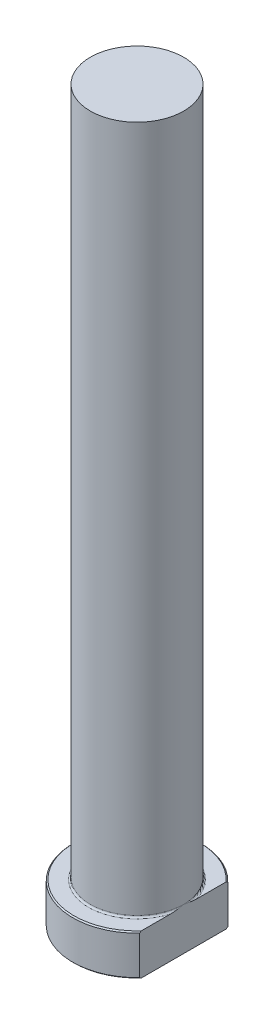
ISO-10303-21;
HEADER;
FILE_DESCRIPTION(('STEP AP214'),'2;1');
FILE_NAME('part.step','',(''),(''),'','','');
FILE_SCHEMA(('AUTOMOTIVE_DESIGN { 1 0 10303 214 1 1 1 1 }'));
ENDSEC;
DATA;
#1=APPLICATION_CONTEXT('core data for automotive mechanical design processes');
#2=APPLICATION_PROTOCOL_DEFINITION('international standard','automotive_design',2000,#1);
#3=PRODUCT_CONTEXT('',#1,'mechanical');
#4=PRODUCT('Part','Part','',(#3));
#5=PRODUCT_RELATED_PRODUCT_CATEGORY('part','',(#4));
#6=PRODUCT_DEFINITION_FORMATION('','',#4);
#7=PRODUCT_DEFINITION_CONTEXT('part definition',#1,'design');
#8=PRODUCT_DEFINITION('design','',#6,#7);
#9=PRODUCT_DEFINITION_SHAPE('','',#8);
#10=(LENGTH_UNIT() NAMED_UNIT(*) SI_UNIT(.MILLI.,.METRE.));
#11=(NAMED_UNIT(*) PLANE_ANGLE_UNIT() SI_UNIT($,.RADIAN.));
#12=(NAMED_UNIT(*) SI_UNIT($,.STERADIAN.) SOLID_ANGLE_UNIT());
#13=UNCERTAINTY_MEASURE_WITH_UNIT(LENGTH_MEASURE(1.E-05),#10,'distance_accuracy_value','');
#14=(GEOMETRIC_REPRESENTATION_CONTEXT(3) GLOBAL_UNCERTAINTY_ASSIGNED_CONTEXT((#13)) GLOBAL_UNIT_ASSIGNED_CONTEXT((#10,
#11,#12)) REPRESENTATION_CONTEXT('',''));
#15=CARTESIAN_POINT('',(0.,0.,0.));
#16=DIRECTION('',(0.,0.,1.));
#17=DIRECTION('',(1.,0.,0.));
#18=AXIS2_PLACEMENT_3D('',#15,#16,#17);
#19=CARTESIAN_POINT('',(0.,0.,0.));
#20=DIRECTION('',(0.,-1.,0.));
#21=DIRECTION('',(0.,0.,-1.));
#22=AXIS2_PLACEMENT_3D('',#19,#20,#21);
#23=PLANE('',#22);
#24=CARTESIAN_POINT('',(0.,0.,0.));
#25=DIRECTION('',(0.,-1.,0.));
#26=DIRECTION('',(0.,0.,-1.));
#27=AXIS2_PLACEMENT_3D('',#24,#25,#26);
#28=CIRCLE('',#27,10.8);
#29=CARTESIAN_POINT('',(7.99999999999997,0.,7.25534285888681));
#30=VERTEX_POINT('',#29);
#31=CARTESIAN_POINT('',(7.99999999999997,0.,-7.25534285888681));
#32=VERTEX_POINT('',#31);
#33=EDGE_CURVE('E98',#30,#32,#28,.T.);
#34=ORIENTED_EDGE('',*,*,#33,.T.);
#35=DIRECTION('',(0.,0.,1.));
#36=VECTOR('',#35,1.);
#37=CARTESIAN_POINT('',(7.99999999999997,0.,-7.54983443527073));
#38=LINE('',#37,#36);
#39=EDGE_CURVE('E83',#32,#30,#38,.T.);
#40=ORIENTED_EDGE('',*,*,#39,.T.);
#41=EDGE_LOOP('',(#34,#40));
#42=FACE_BOUND('',#41,.T.);
#43=ADVANCED_FACE('F32',(#42),#23,.T.);
#44=CARTESIAN_POINT('',(0.,259.958771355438,0.));
#45=DIRECTION('',(0.,1.,0.));
#46=DIRECTION('',(0.,0.,1.));
#47=AXIS2_PLACEMENT_3D('',#44,#45,#46);
#48=CYLINDRICAL_SURFACE('',#47,11.);
#49=CARTESIAN_POINT('',(0.,6.80000000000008,0.));
#50=DIRECTION('',(0.,1.,0.));
#51=DIRECTION('',(0.,0.,1.));
#52=AXIS2_PLACEMENT_3D('',#49,#50,#51);
#53=CIRCLE('',#52,11.);
#54=CARTESIAN_POINT('',(7.99999999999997,6.80000000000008,7.54983443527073));
#55=VERTEX_POINT('',#54);
#56=CARTESIAN_POINT('',(7.99999999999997,6.80000000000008,-7.54983443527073));
#57=VERTEX_POINT('',#56);
#58=EDGE_CURVE('E104',#55,#57,#53,.F.);
#59=ORIENTED_EDGE('',*,*,#58,.T.);
#60=DIRECTION('',(0.,-1.,0.));
#61=VECTOR('',#60,1.);
#62=CARTESIAN_POINT('',(7.99999999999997,125.,-7.54983443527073));
#63=LINE('',#62,#61);
#64=CARTESIAN_POINT('',(7.99999999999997,0.199999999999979,-7.54983443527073));
#65=VERTEX_POINT('',#64);
#66=EDGE_CURVE('E183',#57,#65,#63,.T.);
#67=ORIENTED_EDGE('',*,*,#66,.T.);
#68=CARTESIAN_POINT('',(0.,0.199999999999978,0.));
#69=DIRECTION('',(0.,-1.,0.));
#70=DIRECTION('',(0.,0.,-1.));
#71=AXIS2_PLACEMENT_3D('',#68,#69,#70);
#72=CIRCLE('',#71,11.);
#73=CARTESIAN_POINT('',(7.99999999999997,0.199999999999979,7.54983443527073));
#74=VERTEX_POINT('',#73);
#75=EDGE_CURVE('E100',#65,#74,#72,.F.);
#76=ORIENTED_EDGE('',*,*,#75,.T.);
#77=DIRECTION('',(0.,-1.,0.));
#78=VECTOR('',#77,1.);
#79=CARTESIAN_POINT('',(7.99999999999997,125.,7.54983443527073));
#80=LINE('',#79,#78);
#81=EDGE_CURVE('E93',#55,#74,#80,.T.);
#82=ORIENTED_EDGE('',*,*,#81,.F.);
#83=EDGE_LOOP('',(#59,#67,#76,#82));
#84=FACE_BOUND('',#83,.T.);
#85=ADVANCED_FACE('F158',(#84),#48,.T.);
#86=CARTESIAN_POINT('',(-11.,7.,0.));
#87=DIRECTION('',(0.,1.,0.));
#88=DIRECTION('',(0.,0.,1.));
#89=AXIS2_PLACEMENT_3D('',#86,#87,#88);
#90=PLANE('',#89);
#91=CARTESIAN_POINT('',(0.,7.,0.));
#92=DIRECTION('',(0.,1.,0.));
#93=DIRECTION('',(0.,0.,1.));
#94=AXIS2_PLACEMENT_3D('',#91,#92,#93);
#95=CIRCLE('',#94,10.8);
#96=CARTESIAN_POINT('',(7.99999999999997,7.,-7.25534285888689));
#97=VERTEX_POINT('',#96);
#98=CARTESIAN_POINT('',(7.99999999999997,7.,7.25534285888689));
#99=VERTEX_POINT('',#98);
#100=EDGE_CURVE('E178',#97,#99,#95,.T.);
#101=ORIENTED_EDGE('',*,*,#100,.T.);
#102=DIRECTION('',(0.,0.,-1.));
#103=VECTOR('',#102,1.);
#104=CARTESIAN_POINT('',(7.99999999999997,7.,0.));
#105=LINE('',#104,#103);
#106=CARTESIAN_POINT('',(7.99999999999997,6.99999999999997,2.21133443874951));
#107=VERTEX_POINT('',#106);
#108=EDGE_CURVE('E57',#99,#107,#105,.T.);
#109=ORIENTED_EDGE('',*,*,#108,.T.);
#110=CARTESIAN_POINT('',(0.,7.,0.));
#111=DIRECTION('',(0.,1.,0.));
#112=DIRECTION('',(0.,0.,1.));
#113=AXIS2_PLACEMENT_3D('',#110,#111,#112);
#114=CIRCLE('',#113,8.29999999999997);
#115=CARTESIAN_POINT('',(7.99999999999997,6.99999999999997,-2.21133443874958));
#116=VERTEX_POINT('',#115);
#117=EDGE_CURVE('E107',#107,#116,#114,.F.);
#118=ORIENTED_EDGE('',*,*,#117,.T.);
#119=EDGE_CURVE('E136',#116,#97,#105,.T.);
#120=ORIENTED_EDGE('',*,*,#119,.T.);
#121=EDGE_LOOP('',(#101,#109,#118,#120));
#122=FACE_BOUND('',#121,.T.);
#123=ADVANCED_FACE('F147',(#122),#90,.T.);
#124=CARTESIAN_POINT('',(0.,7.00000000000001,0.));
#125=DIRECTION('',(0.,-1.,0.));
#126=DIRECTION('',(0.,0.,-1.));
#127=AXIS2_PLACEMENT_3D('',#124,#125,#126);
#128=CONICAL_SURFACE('',#127,10.8,0.785398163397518);
#129=ORIENTED_EDGE('',*,*,#58,.F.);
#130=CARTESIAN_POINT('',(7.99999999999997,-0.636730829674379,16.6106304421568));
#131=CARTESIAN_POINT('',(7.99999999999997,-0.418611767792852,16.3685283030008));
#132=CARTESIAN_POINT('',(7.99999999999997,-0.200984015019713,16.125984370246));
#133=CARTESIAN_POINT('',(7.99999999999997,0.233148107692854,15.6398927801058));
#134=CARTESIAN_POINT('',(7.99999999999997,0.449652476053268,15.3963451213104));
#135=CARTESIAN_POINT('',(7.99999999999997,1.09739989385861,14.663868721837));
#136=CARTESIAN_POINT('',(7.99999999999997,1.52674426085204,14.1732538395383));
#137=CARTESIAN_POINT('',(7.99999999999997,2.1679281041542,13.4304656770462));
#138=CARTESIAN_POINT('',(7.99999999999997,2.38226067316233,13.1804430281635));
#139=CARTESIAN_POINT('',(7.99999999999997,2.80892954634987,12.6787083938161));
#140=CARTESIAN_POINT('',(7.99999999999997,3.02126589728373,12.4269964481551));
#141=CARTESIAN_POINT('',(7.99999999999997,3.44357020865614,11.9216744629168));
#142=CARTESIAN_POINT('',(7.99999999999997,3.65353861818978,11.6680647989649));
#143=CARTESIAN_POINT('',(7.99999999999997,4.07074862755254,11.1585723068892));
#144=CARTESIAN_POINT('',(7.99999999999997,4.27798998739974,10.9026892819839));
#145=CARTESIAN_POINT('',(7.99999999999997,4.66965190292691,10.4127607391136));
#146=CARTESIAN_POINT('',(7.99999999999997,4.85436868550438,10.1789522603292));
#147=CARTESIAN_POINT('',(7.99999999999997,5.22063517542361,9.70886883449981));
#148=CARTESIAN_POINT('',(7.99999999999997,5.40218492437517,9.47259391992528));
#149=CARTESIAN_POINT('',(7.99999999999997,5.76149237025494,8.99721569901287));
#150=CARTESIAN_POINT('',(7.99999999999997,5.9392505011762,8.75811272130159));
#151=CARTESIAN_POINT('',(7.99999999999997,6.29022306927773,8.27660199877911));
#152=CARTESIAN_POINT('',(7.99999999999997,6.46343768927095,8.03419438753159));
#153=CARTESIAN_POINT('',(7.99999999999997,6.803984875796,7.54604999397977));
#154=CARTESIAN_POINT('',(7.99999999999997,6.97132935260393,7.30032154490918));
#155=CARTESIAN_POINT('',(7.99999999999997,7.29928849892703,6.80437777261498));
#156=CARTESIAN_POINT('',(7.99999999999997,7.45990280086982,6.55416220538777));
#157=CARTESIAN_POINT('',(7.99999999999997,7.77264940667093,6.04873149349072));
#158=CARTESIAN_POINT('',(7.99999999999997,7.92478824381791,5.79352041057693));
#159=CARTESIAN_POINT('',(7.99999999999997,8.21859570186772,5.27715744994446));
#160=CARTESIAN_POINT('',(7.99999999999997,8.36026610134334,5.01600659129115));
#161=CARTESIAN_POINT('',(7.99999999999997,8.62213596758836,4.50319242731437));
#162=CARTESIAN_POINT('',(7.99999999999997,8.74311989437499,4.25193242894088));
#163=CARTESIAN_POINT('',(7.99999999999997,8.97065709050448,3.74287674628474));
#164=CARTESIAN_POINT('',(7.99999999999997,9.07720941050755,3.48508063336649));
#165=CARTESIAN_POINT('',(7.99999999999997,9.27220860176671,2.96337495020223));
#166=CARTESIAN_POINT('',(7.99999999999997,9.36069936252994,2.69948197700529));
#167=CARTESIAN_POINT('',(7.99999999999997,9.51604316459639,2.16542713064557));
#168=CARTESIAN_POINT('',(7.99999999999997,9.58290677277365,1.89526838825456));
#169=CARTESIAN_POINT('',(7.99999999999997,9.68291221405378,1.39216000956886));
#170=CARTESIAN_POINT('',(7.99999999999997,9.71967474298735,1.15993430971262));
#171=CARTESIAN_POINT('',(7.99999999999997,9.77336730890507,0.693196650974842));
#172=CARTESIAN_POINT('',(7.99999999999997,9.79030037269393,0.45868504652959));
#173=CARTESIAN_POINT('',(7.99999999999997,9.80342851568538,-0.0106727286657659));
#174=CARTESIAN_POINT('',(7.99999999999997,9.79964609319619,-0.245518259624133));
#175=CARTESIAN_POINT('',(7.99999999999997,9.77160926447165,-0.713989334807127));
#176=CARTESIAN_POINT('',(7.99999999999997,9.74735189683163,-0.947614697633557));
#177=CARTESIAN_POINT('',(7.99999999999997,9.67070830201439,-1.47287443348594));
#178=CARTESIAN_POINT('',(7.99999999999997,9.61261890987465,-1.76367634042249));
#179=CARTESIAN_POINT('',(7.99999999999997,9.46982192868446,-2.33873282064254));
#180=CARTESIAN_POINT('',(7.99999999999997,9.38509750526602,-2.62298313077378));
#181=CARTESIAN_POINT('',(7.99999999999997,9.24134311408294,-3.04436856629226));
#182=CARTESIAN_POINT('',(7.99999999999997,9.19048552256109,-3.18437323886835));
#183=CARTESIAN_POINT('',(7.99999999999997,9.08381674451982,-3.46241560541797));
#184=CARTESIAN_POINT('',(7.99999999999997,9.0280078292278,-3.60045416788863));
#185=CARTESIAN_POINT('',(7.99999999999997,8.91195481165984,-3.87463242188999));
#186=CARTESIAN_POINT('',(7.99999999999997,8.85171106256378,-4.01077226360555));
#187=CARTESIAN_POINT('',(7.99999999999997,8.72725899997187,-4.28124317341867));
#188=CARTESIAN_POINT('',(7.99999999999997,8.6630501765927,-4.41557400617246));
#189=CARTESIAN_POINT('',(7.99999999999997,8.48984738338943,-4.76597692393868));
#190=CARTESIAN_POINT('',(7.99999999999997,8.37796178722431,-4.98062176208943));
#191=CARTESIAN_POINT('',(7.99999999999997,8.14649205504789,-5.40573762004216));
#192=CARTESIAN_POINT('',(7.99999999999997,8.02690659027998,-5.61620791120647));
#193=CARTESIAN_POINT('',(7.99999999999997,7.78128707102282,-6.0334958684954));
#194=CARTESIAN_POINT('',(7.99999999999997,7.65524949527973,-6.24031145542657));
#195=CARTESIAN_POINT('',(7.99999999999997,7.39783636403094,-6.65060320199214));
#196=CARTESIAN_POINT('',(7.99999999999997,7.26646042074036,-6.85407911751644));
#197=CARTESIAN_POINT('',(7.99999999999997,6.99890352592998,-7.2585639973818));
#198=CARTESIAN_POINT('',(7.99999999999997,6.86271149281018,-7.45956561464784));
#199=CARTESIAN_POINT('',(7.99999999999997,6.58651908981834,-7.85893907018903));
#200=CARTESIAN_POINT('',(7.99999999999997,6.44651858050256,-8.05731081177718));
#201=CARTESIAN_POINT('',(7.99999999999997,6.02178241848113,-8.64881247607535));
#202=CARTESIAN_POINT('',(7.99999999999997,5.73221467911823,-9.0384743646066));
#203=CARTESIAN_POINT('',(7.99999999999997,5.14234581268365,-9.81218500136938));
#204=CARTESIAN_POINT('',(7.99999999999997,4.84200393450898,-10.1962024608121));
#205=CARTESIAN_POINT('',(7.99999999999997,4.23404813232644,-10.9584616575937));
#206=CARTESIAN_POINT('',(7.99999999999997,3.92643376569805,-11.3367030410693));
#207=CARTESIAN_POINT('',(7.99999999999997,3.30600745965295,-12.088035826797));
#208=CARTESIAN_POINT('',(7.99999999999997,2.99320302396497,-12.4611334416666));
#209=CARTESIAN_POINT('',(7.99999999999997,2.36317801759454,-13.2035599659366));
#210=CARTESIAN_POINT('',(7.99999999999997,2.04595754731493,-13.5728889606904));
#211=CARTESIAN_POINT('',(7.99999999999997,1.33644011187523,-14.3909378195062));
#212=CARTESIAN_POINT('',(7.99999999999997,0.943258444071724,-14.8388897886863));
#213=CARTESIAN_POINT('',(7.99999999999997,0.35148359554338,-15.5068127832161));
#214=CARTESIAN_POINT('',(7.99999999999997,0.1544490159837,-15.7281687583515));
#215=CARTESIAN_POINT('',(7.99999999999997,-0.240498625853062,-16.1700151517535));
#216=CARTESIAN_POINT('',(7.99999999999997,-0.438411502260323,-16.3905057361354));
#217=CARTESIAN_POINT('',(7.99999999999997,-0.636730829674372,-16.6106304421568));
#218=B_SPLINE_CURVE_WITH_KNOTS('',3,(#130,#131,#132,#133,#134,#135,#136,#137,#138,#139,#140,
#141,#142,#143,#144,#145,#146,#147,#148,#149,#150,#151,#152,#153,#154,#155,#156,#157,#158,#159,
#160,#161,#162,#163,#164,#165,#166,#167,#168,#169,#170,#171,#172,#173,#174,#175,#176,#177,#178,
#179,#180,#181,#182,#183,#184,#185,#186,#187,#188,#189,#190,#191,#192,#193,#194,#195,#196,#197,
#198,#199,#200,#201,#202,#203,#204,#205,#206,#207,#208,#209,#210,#211,#212,#213,#214,#215,#216,
#217),.UNSPECIFIED.,.F.,.F.,(4,2,2,2,2,2,2,2,2,2,2,2,2,2,2,2,2,2,2,2,2,2,2,2,2,2,2,2,2,2,2,2,2,
2,2,2,2,2,2,2,2,2,2,4),(0.,0.977598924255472,1.95519922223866,3.91099512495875,4.89893858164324,
5.88685884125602,6.87458847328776,7.86240445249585,8.75629469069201,9.65017317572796,
10.5439487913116,11.4376883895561,12.3294952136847,13.2213506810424,14.112508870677,
15.0035153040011,15.8397621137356,16.6760639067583,17.5103086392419,18.3441451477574,
19.0487229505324,19.7531931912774,20.4568984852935,21.160705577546,22.0488428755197,
22.9375426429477,23.384333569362,23.8309205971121,24.277472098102,24.724081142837,
25.4500411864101,26.1761268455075,26.9026130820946,27.629152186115,28.3574884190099,
29.085851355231,30.5420520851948,32.0045059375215,33.4670490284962,34.9276355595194,
36.3881889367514,38.1762452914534,39.0652821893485,39.95413915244),.UNSPECIFIED.);
#219=EDGE_CURVE('E135',#55,#99,#218,.T.);
#220=ORIENTED_EDGE('',*,*,#219,.T.);
#221=ORIENTED_EDGE('',*,*,#100,.F.);
#222=EDGE_CURVE('E127',#97,#57,#218,.T.);
#223=ORIENTED_EDGE('',*,*,#222,.T.);
#224=EDGE_LOOP('',(#129,#220,#221,#223));
#225=FACE_BOUND('',#224,.T.);
#226=ADVANCED_FACE('F143',(#225),#128,.T.);
#227=CARTESIAN_POINT('',(0.,0.199999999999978,0.));
#228=DIRECTION('',(0.,1.,0.));
#229=DIRECTION('',(0.,0.,1.));
#230=AXIS2_PLACEMENT_3D('',#227,#228,#229);
#231=CONICAL_SURFACE('',#230,11.,0.785398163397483);
#232=ORIENTED_EDGE('',*,*,#75,.F.);
#233=CARTESIAN_POINT('',(7.99999999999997,7.63673082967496,-16.6106304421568));
#234=CARTESIAN_POINT('',(7.99999999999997,7.41861176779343,-16.3685283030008));
#235=CARTESIAN_POINT('',(7.99999999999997,7.20098401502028,-16.125984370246));
#236=CARTESIAN_POINT('',(7.99999999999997,6.7668518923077,-15.6398927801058));
#237=CARTESIAN_POINT('',(7.99999999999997,6.55034752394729,-15.3963451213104));
#238=CARTESIAN_POINT('',(7.99999999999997,5.90260010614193,-14.6638687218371));
#239=CARTESIAN_POINT('',(7.99999999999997,5.47325573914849,-14.1732538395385));
#240=CARTESIAN_POINT('',(7.99999999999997,4.83207189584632,-13.4304656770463));
#241=CARTESIAN_POINT('',(7.99999999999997,4.61773932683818,-13.1804430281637));
#242=CARTESIAN_POINT('',(7.99999999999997,4.19107045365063,-12.6787083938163));
#243=CARTESIAN_POINT('',(7.99999999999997,3.97873410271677,-12.4269964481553));
#244=CARTESIAN_POINT('',(7.99999999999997,3.55642979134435,-11.9216744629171));
#245=CARTESIAN_POINT('',(7.99999999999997,3.34646138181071,-11.6680647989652));
#246=CARTESIAN_POINT('',(7.99999999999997,2.92925137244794,-11.1585723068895));
#247=CARTESIAN_POINT('',(7.99999999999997,2.72201001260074,-10.9026892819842));
#248=CARTESIAN_POINT('',(7.99999999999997,2.33034809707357,-10.412760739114));
#249=CARTESIAN_POINT('',(7.99999999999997,2.14563131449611,-10.1789522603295));
#250=CARTESIAN_POINT('',(7.99999999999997,1.7793648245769,-9.70886883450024));
#251=CARTESIAN_POINT('',(7.99999999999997,1.59781507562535,-9.47259391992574));
#252=CARTESIAN_POINT('',(7.99999999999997,1.23850762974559,-8.9972156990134));
#253=CARTESIAN_POINT('',(7.99999999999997,1.06074949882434,-8.75811272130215));
#254=CARTESIAN_POINT('',(7.99999999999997,0.709776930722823,-8.27660199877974));
#255=CARTESIAN_POINT('',(7.99999999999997,0.536562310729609,-8.03419438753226));
#256=CARTESIAN_POINT('',(7.99999999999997,0.196015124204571,-7.54604999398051));
#257=CARTESIAN_POINT('',(7.99999999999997,0.0286706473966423,-7.30032154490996));
#258=CARTESIAN_POINT('',(7.99999999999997,-0.299288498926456,-6.80437777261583));
#259=CARTESIAN_POINT('',(7.99999999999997,-0.459902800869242,-6.55416220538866));
#260=CARTESIAN_POINT('',(7.99999999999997,-0.772649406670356,-6.04873149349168));
#261=CARTESIAN_POINT('',(7.99999999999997,-0.924788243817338,-5.79352041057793));
#262=CARTESIAN_POINT('',(7.99999999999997,-1.21859570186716,-5.27715744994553));
#263=CARTESIAN_POINT('',(7.99999999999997,-1.36026610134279,-5.01600659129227));
#264=CARTESIAN_POINT('',(7.99999999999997,-1.62213596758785,-4.50319242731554));
#265=CARTESIAN_POINT('',(7.99999999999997,-1.74311989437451,-4.25193242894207));
#266=CARTESIAN_POINT('',(7.99999999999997,-1.97065709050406,-3.74287674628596));
#267=CARTESIAN_POINT('',(7.99999999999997,-2.07720941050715,-3.48508063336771));
#268=CARTESIAN_POINT('',(7.99999999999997,-2.27220860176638,-2.96337495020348));
#269=CARTESIAN_POINT('',(7.99999999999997,-2.36069936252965,-2.69948197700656));
#270=CARTESIAN_POINT('',(7.99999999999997,-2.51604316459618,-2.16542713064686));
#271=CARTESIAN_POINT('',(7.99999999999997,-2.58290677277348,-1.89526838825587));
#272=CARTESIAN_POINT('',(7.99999999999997,-2.68291221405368,-1.3921600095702));
#273=CARTESIAN_POINT('',(7.99999999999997,-2.7196747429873,-1.15993430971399));
#274=CARTESIAN_POINT('',(7.99999999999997,-2.77336730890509,-0.693196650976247));
#275=CARTESIAN_POINT('',(7.99999999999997,-2.790300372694,-0.458685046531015));
#276=CARTESIAN_POINT('',(7.99999999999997,-2.80342851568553,0.0106727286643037));
#277=CARTESIAN_POINT('',(7.99999999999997,-2.79964609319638,0.245518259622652));
#278=CARTESIAN_POINT('',(7.99999999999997,-2.77160926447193,0.713989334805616));
#279=CARTESIAN_POINT('',(7.99999999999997,-2.74735189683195,0.947614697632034));
#280=CARTESIAN_POINT('',(7.99999999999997,-2.67070830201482,1.47287443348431));
#281=CARTESIAN_POINT('',(7.99999999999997,-2.61261890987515,1.76367634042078));
#282=CARTESIAN_POINT('',(7.99999999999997,-2.46982192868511,2.33873282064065));
#283=CARTESIAN_POINT('',(7.99999999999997,-2.38509750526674,2.62298313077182));
#284=CARTESIAN_POINT('',(7.99999999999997,-2.24134311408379,3.04436856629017));
#285=CARTESIAN_POINT('',(7.99999999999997,-2.19048552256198,3.18437323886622));
#286=CARTESIAN_POINT('',(7.99999999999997,-2.0838167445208,3.46241560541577));
#287=CARTESIAN_POINT('',(7.99999999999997,-2.02800782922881,3.60045416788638));
#288=CARTESIAN_POINT('',(7.99999999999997,-1.91195481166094,3.87463242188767));
#289=CARTESIAN_POINT('',(7.99999999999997,-1.85171106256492,4.0107722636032));
#290=CARTESIAN_POINT('',(7.99999999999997,-1.72725899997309,4.28124317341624));
#291=CARTESIAN_POINT('',(7.99999999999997,-1.66305017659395,4.41557400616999));
#292=CARTESIAN_POINT('',(7.99999999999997,-1.48984738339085,4.765976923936));
#293=CARTESIAN_POINT('',(7.99999999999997,-1.37796178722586,4.98062176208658));
#294=CARTESIAN_POINT('',(7.99999999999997,-1.1464920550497,5.40573762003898));
#295=CARTESIAN_POINT('',(7.99999999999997,-1.02690659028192,5.61620791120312));
#296=CARTESIAN_POINT('',(7.99999999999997,-0.781287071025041,6.03349586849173));
#297=CARTESIAN_POINT('',(7.99999999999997,-0.65524949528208,6.24031145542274));
#298=CARTESIAN_POINT('',(7.99999999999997,-0.397836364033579,6.65060320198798));
#299=CARTESIAN_POINT('',(7.99999999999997,-0.266460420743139,6.85407911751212));
#300=CARTESIAN_POINT('',(7.99999999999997,0.00109647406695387,7.25856399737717));
#301=CARTESIAN_POINT('',(7.99999999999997,0.137288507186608,7.45956561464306));
#302=CARTESIAN_POINT('',(7.99999999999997,0.413480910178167,7.85893907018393));
#303=CARTESIAN_POINT('',(7.99999999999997,0.553481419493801,8.05731081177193));
#304=CARTESIAN_POINT('',(7.99999999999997,0.978217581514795,8.64881247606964));
#305=CARTESIAN_POINT('',(7.99999999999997,1.26778532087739,9.03847436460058));
#306=CARTESIAN_POINT('',(7.99999999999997,1.85765418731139,9.81218500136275));
#307=CARTESIAN_POINT('',(7.99999999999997,2.15799606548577,10.1962024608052));
#308=CARTESIAN_POINT('',(7.99999999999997,2.76595186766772,10.9584616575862));
#309=CARTESIAN_POINT('',(7.99999999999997,3.07356623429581,11.3367030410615));
#310=CARTESIAN_POINT('',(7.99999999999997,3.69399254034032,12.0880358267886));
#311=CARTESIAN_POINT('',(7.99999999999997,4.00679697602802,12.4611334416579));
#312=CARTESIAN_POINT('',(7.99999999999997,4.63682198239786,13.2035599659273));
#313=CARTESIAN_POINT('',(7.99999999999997,4.95404245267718,13.5728889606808));
#314=CARTESIAN_POINT('',(7.99999999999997,5.66355988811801,14.390937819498));
#315=CARTESIAN_POINT('',(7.99999999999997,6.05674155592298,14.8388897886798));
#316=CARTESIAN_POINT('',(7.99999999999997,6.64851640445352,15.5068127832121));
#317=CARTESIAN_POINT('',(7.99999999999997,6.84555098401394,15.7281687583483));
#318=CARTESIAN_POINT('',(7.99999999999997,7.24049862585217,16.1700151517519));
#319=CARTESIAN_POINT('',(7.99999999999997,7.43841150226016,16.3905057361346));
#320=CARTESIAN_POINT('',(7.99999999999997,7.63673082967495,16.6106304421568));
#321=B_SPLINE_CURVE_WITH_KNOTS('',3,(#233,#234,#235,#236,#237,#238,#239,#240,#241,#242,#243,
#244,#245,#246,#247,#248,#249,#250,#251,#252,#253,#254,#255,#256,#257,#258,#259,#260,#261,#262,
#263,#264,#265,#266,#267,#268,#269,#270,#271,#272,#273,#274,#275,#276,#277,#278,#279,#280,#281,
#282,#283,#284,#285,#286,#287,#288,#289,#290,#291,#292,#293,#294,#295,#296,#297,#298,#299,#300,
#301,#302,#303,#304,#305,#306,#307,#308,#309,#310,#311,#312,#313,#314,#315,#316,#317,#318,#319,
#320),.UNSPECIFIED.,.F.,.F.,(4,2,2,2,2,2,2,2,2,2,2,2,2,2,2,2,2,2,2,2,2,2,2,2,2,2,2,2,2,2,2,2,2,
2,2,2,2,2,2,2,2,2,2,4),(0.,0.977598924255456,1.95519922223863,3.91099512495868,4.89893858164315,
5.88685884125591,6.87458847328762,7.86240445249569,8.75629469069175,9.65017317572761,
10.5439487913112,11.4376883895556,12.3294952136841,13.2213506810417,14.1125088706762,
15.0035153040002,15.8397621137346,16.6760639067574,17.5103086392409,18.3441451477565,
19.0487229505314,19.7531931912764,20.4568984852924,21.1607055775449,22.0488428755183,
22.937542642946,23.3843335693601,23.83092059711,24.2774720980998,24.7240811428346,
25.4500411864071,26.1761268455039,26.9026130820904,27.6291521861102,28.3574884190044,
29.0858513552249,30.5420520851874,32.0045059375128,33.4670490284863,34.9276355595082,
36.388188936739,38.1762452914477,39.0652821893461,39.9541391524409),.UNSPECIFIED.);
#322=EDGE_CURVE('E86',#65,#32,#321,.T.);
#323=ORIENTED_EDGE('',*,*,#322,.T.);
#324=ORIENTED_EDGE('',*,*,#33,.F.);
#325=EDGE_CURVE('E89',#30,#74,#321,.T.);
#326=ORIENTED_EDGE('',*,*,#325,.T.);
#327=EDGE_LOOP('',(#232,#323,#324,#326));
#328=FACE_BOUND('',#327,.T.);
#329=ADVANCED_FACE('F97',(#328),#231,.T.);
#330=CARTESIAN_POINT('',(0.,7.29999999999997,0.));
#331=DIRECTION('',(0.,1.,0.));
#332=DIRECTION('',(0.,0.,1.));
#333=AXIS2_PLACEMENT_3D('',#330,#331,#332);
#334=TOROIDAL_SURFACE('',#333,8.29999999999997,0.3);
#335=CARTESIAN_POINT('',(7.99999999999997,7.29999999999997,0.));
#336=CARTESIAN_POINT('',(7.99999999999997,7.30000062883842,1.41343368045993E-10));
#337=CARTESIAN_POINT('',(7.99999999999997,7.30000125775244,-3.45355322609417E-07));
#338=CARTESIAN_POINT('',(7.99999999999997,7.30000241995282,-1.23398463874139E-06));
#339=CARTESIAN_POINT('',(7.99999999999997,7.30000291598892,-1.80141989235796E-06));
#340=CARTESIAN_POINT('',(7.99999999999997,7.30000399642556,-3.18390842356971E-06));
#341=CARTESIAN_POINT('',(7.99999999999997,7.30000456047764,-4.02115832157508E-06));
#342=CARTESIAN_POINT('',(7.99999999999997,7.30000552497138,-5.71072460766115E-06));
#343=CARTESIAN_POINT('',(7.99999999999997,7.30000593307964,-6.55926444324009E-06));
#344=CARTESIAN_POINT('',(7.99999999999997,7.30000755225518,-1.000964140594E-05));
#345=CARTESIAN_POINT('',(7.99999999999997,7.30000869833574,-1.26477244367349E-05));
#346=CARTESIAN_POINT('',(7.99999999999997,7.30001047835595,-1.77422280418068E-05));
#347=CARTESIAN_POINT('',(7.99999999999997,7.30001115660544,-2.01836505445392E-05));
#348=CARTESIAN_POINT('',(7.99999999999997,7.30001417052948,-3.09435594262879E-05));
#349=CARTESIAN_POINT('',(7.99999999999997,7.30001656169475,-3.92473415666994E-05));
#350=CARTESIAN_POINT('',(7.99999999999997,7.30001991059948,-5.46311733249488E-05));
#351=CARTESIAN_POINT('',(7.99999999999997,7.30002104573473,-6.16717033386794E-05));
#352=CARTESIAN_POINT('',(7.99999999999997,7.30002955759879,-0.000115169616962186));
#353=CARTESIAN_POINT('',(7.99999999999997,7.30003630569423,-0.000161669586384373));
#354=CARTESIAN_POINT('',(7.99999999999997,7.30006581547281,-0.00034712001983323));
#355=CARTESIAN_POINT('',(7.99999999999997,7.30009364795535,-0.000485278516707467));
#356=CARTESIAN_POINT('',(7.99999999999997,7.30020325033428,-0.00103711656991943));
#357=CARTESIAN_POINT('',(7.99999999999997,7.30028197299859,-0.00145117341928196));
#358=CARTESIAN_POINT('',(7.99999999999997,7.30059973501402,-0.00311182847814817));
#359=CARTESIAN_POINT('',(7.99999999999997,7.30084275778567,-0.00435790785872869));
#360=CARTESIAN_POINT('',(7.99999999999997,7.30186073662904,-0.00958966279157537));
#361=CARTESIAN_POINT('',(7.99999999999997,7.30263061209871,-0.0135760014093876));
#362=CARTESIAN_POINT('',(7.99999999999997,7.30870312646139,-0.0450030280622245));
#363=CARTESIAN_POINT('',(7.99999999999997,7.31402334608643,-0.0724414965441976));
#364=CARTESIAN_POINT('',(7.99999999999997,7.32442239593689,-0.126197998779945));
#365=CARTESIAN_POINT('',(7.99999999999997,7.32950218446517,-0.152515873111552));
#366=CARTESIAN_POINT('',(7.99999999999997,7.34609783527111,-0.23868034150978));
#367=CARTESIAN_POINT('',(7.99999999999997,7.35757011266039,-0.29853557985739));
#368=CARTESIAN_POINT('',(7.99999999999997,7.37688511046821,-0.400403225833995));
#369=CARTESIAN_POINT('',(7.99999999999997,7.38478827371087,-0.442404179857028));
#370=CARTESIAN_POINT('',(7.99999999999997,7.40022249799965,-0.525284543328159));
#371=CARTESIAN_POINT('',(7.99999999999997,7.40775782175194,-0.566163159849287));
#372=CARTESIAN_POINT('',(7.99999999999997,7.4322438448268,-0.700743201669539));
#373=CARTESIAN_POINT('',(7.99999999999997,7.44879297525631,-0.794518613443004));
#374=CARTESIAN_POINT('',(7.99999999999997,7.48053424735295,-0.983225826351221));
#375=CARTESIAN_POINT('',(7.99999999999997,7.49571186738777,-1.07816009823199));
#376=CARTESIAN_POINT('',(7.99999999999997,7.52532008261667,-1.27781321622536));
#377=CARTESIAN_POINT('',(7.99999999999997,7.53952614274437,-1.38256589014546));
#378=CARTESIAN_POINT('',(7.99999999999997,7.564310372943,-1.59223320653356));
#379=CARTESIAN_POINT('',(7.99999999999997,7.57489817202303,-1.6971466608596));
#380=CARTESIAN_POINT('',(7.99999999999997,7.58780012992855,-1.86417161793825));
#381=CARTESIAN_POINT('',(7.99999999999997,7.59172630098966,-1.92615747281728));
#382=CARTESIAN_POINT('',(7.99999999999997,7.59748111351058,-2.05022364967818));
#383=CARTESIAN_POINT('',(7.99999999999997,7.59931001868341,-2.11230395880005));
#384=CARTESIAN_POINT('',(7.99999999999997,7.60036180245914,-2.23528941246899));
#385=CARTESIAN_POINT('',(7.99999999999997,7.59963462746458,-2.29619395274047));
#386=CARTESIAN_POINT('',(7.99999999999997,7.59500883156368,-2.41785147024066));
#387=CARTESIAN_POINT('',(7.99999999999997,7.59111224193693,-2.47860451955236));
#388=CARTESIAN_POINT('',(7.99999999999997,7.57906933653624,-2.60042626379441));
#389=CARTESIAN_POINT('',(7.99999999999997,7.570876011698,-2.66149089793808));
#390=CARTESIAN_POINT('',(7.99999999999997,7.55390997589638,-2.7523359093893));
#391=CARTESIAN_POINT('',(7.99999999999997,7.54745990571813,-2.78254437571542));
#392=CARTESIAN_POINT('',(7.99999999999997,7.5325641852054,-2.84244543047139));
#393=CARTESIAN_POINT('',(7.99999999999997,7.52412026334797,-2.87213844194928));
#394=CARTESIAN_POINT('',(7.99999999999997,7.50454333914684,-2.93081083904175));
#395=CARTESIAN_POINT('',(7.99999999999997,7.4933995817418,-2.95978684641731));
#396=CARTESIAN_POINT('',(7.99999999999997,7.47379430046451,-3.00191342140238));
#397=CARTESIAN_POINT('',(7.99999999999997,7.46677809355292,-3.01573193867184));
#398=CARTESIAN_POINT('',(7.99999999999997,7.45153430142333,-3.04267574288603));
#399=CARTESIAN_POINT('',(7.99999999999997,7.44330842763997,-3.05580197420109));
#400=CARTESIAN_POINT('',(7.99999999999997,7.42520334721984,-3.0811225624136));
#401=CARTESIAN_POINT('',(7.99999999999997,7.41530529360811,-3.09330368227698));
#402=CARTESIAN_POINT('',(7.99999999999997,7.39348961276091,-3.11567039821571));
#403=CARTESIAN_POINT('',(7.99999999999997,7.38158911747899,-3.12587146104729));
#404=CARTESIAN_POINT('',(7.99999999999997,7.3626809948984,-3.13802739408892));
#405=CARTESIAN_POINT('',(7.99999999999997,7.35660667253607,-3.14142291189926));
#406=CARTESIAN_POINT('',(7.99999999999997,7.34401523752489,-3.14727797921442));
#407=CARTESIAN_POINT('',(7.99999999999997,7.33749832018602,-3.14973793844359));
#408=CARTESIAN_POINT('',(7.99999999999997,7.32406766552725,-3.15352036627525));
#409=CARTESIAN_POINT('',(7.99999999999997,7.31715078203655,-3.15483196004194));
#410=CARTESIAN_POINT('',(7.99999999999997,7.30319454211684,-3.15612126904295));
#411=CARTESIAN_POINT('',(7.99999999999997,7.29615528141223,-3.15609998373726));
#412=CARTESIAN_POINT('',(7.99999999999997,7.28287791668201,-3.15479583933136));
#413=CARTESIAN_POINT('',(7.99999999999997,7.27662738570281,-3.15363338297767));
#414=CARTESIAN_POINT('',(7.99999999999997,7.26438977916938,-3.15033645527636));
#415=CARTESIAN_POINT('',(7.99999999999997,7.25840290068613,-3.14820126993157));
#416=CARTESIAN_POINT('',(7.99999999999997,7.24428488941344,-3.14202752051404));
#417=CARTESIAN_POINT('',(7.99999999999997,7.2363403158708,-3.13756526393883));
#418=CARTESIAN_POINT('',(7.99999999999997,7.22124755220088,-3.1274544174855));
#419=CARTESIAN_POINT('',(7.99999999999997,7.21410153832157,-3.12180270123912));
#420=CARTESIAN_POINT('',(7.99999999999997,7.19559955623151,-3.10524942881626));
#421=CARTESIAN_POINT('',(7.99999999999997,7.18498382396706,-3.09352989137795));
#422=CARTESIAN_POINT('',(7.99999999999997,7.16550497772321,-3.068745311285));
#423=CARTESIAN_POINT('',(7.99999999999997,7.15664572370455,-3.05567739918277));
#424=CARTESIAN_POINT('',(7.99999999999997,7.13735489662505,-3.02391619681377));
#425=CARTESIAN_POINT('',(7.99999999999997,7.12749252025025,-3.00488123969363));
#426=CARTESIAN_POINT('',(7.99999999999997,7.10958189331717,-2.96596235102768));
#427=CARTESIAN_POINT('',(7.99999999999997,7.10153733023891,-2.9460767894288));
#428=CARTESIAN_POINT('',(7.99999999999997,7.08679055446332,-2.90559744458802));
#429=CARTESIAN_POINT('',(7.99999999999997,7.08010240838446,-2.88499860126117));
#430=CARTESIAN_POINT('',(7.99999999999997,7.06789000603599,-2.84348873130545));
#431=CARTESIAN_POINT('',(7.99999999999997,7.06236453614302,-2.8225780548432));
#432=CARTESIAN_POINT('',(7.99999999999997,7.04913807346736,-2.76752236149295));
#433=CARTESIAN_POINT('',(7.99999999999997,7.04220598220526,-2.73319311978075));
#434=CARTESIAN_POINT('',(7.99999999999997,7.0302605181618,-2.66419726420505));
#435=CARTESIAN_POINT('',(7.99999999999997,7.02524820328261,-2.62953047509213));
#436=CARTESIAN_POINT('',(7.99999999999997,7.0124950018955,-2.52504816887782));
#437=CARTESIAN_POINT('',(7.99999999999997,7.00708017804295,-2.45494936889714));
#438=CARTESIAN_POINT('',(7.99999999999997,7.000733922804,-2.31725135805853));
#439=CARTESIAN_POINT('',(7.99999999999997,6.99964073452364,-2.24965783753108));
#440=CARTESIAN_POINT('',(7.99999999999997,7.00055672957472,-2.11488194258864));
#441=CARTESIAN_POINT('',(7.99999999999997,7.00254831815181,-2.04769941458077));
#442=CARTESIAN_POINT('',(7.99999999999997,7.00911662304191,-1.91019632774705));
#443=CARTESIAN_POINT('',(7.99999999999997,7.01381425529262,-1.83988191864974));
#444=CARTESIAN_POINT('',(7.99999999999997,7.02534418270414,-1.69947139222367));
#445=CARTESIAN_POINT('',(7.99999999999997,7.0321753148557,-1.62937517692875));
#446=CARTESIAN_POINT('',(7.99999999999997,7.04774659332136,-1.48770318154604));
#447=CARTESIAN_POINT('',(7.99999999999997,7.05652844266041,-1.41613205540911));
#448=CARTESIAN_POINT('',(7.99999999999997,7.0755719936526,-1.2729917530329));
#449=CARTESIAN_POINT('',(7.99999999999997,7.08583764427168,-1.20142310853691));
#450=CARTESIAN_POINT('',(7.99999999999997,7.11167035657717,-1.03117663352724));
#451=CARTESIAN_POINT('',(7.99999999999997,7.12776522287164,-0.932579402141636));
#452=CARTESIAN_POINT('',(7.99999999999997,7.16130143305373,-0.736797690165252));
#453=CARTESIAN_POINT('',(7.99999999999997,7.1787249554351,-0.639610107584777));
#454=CARTESIAN_POINT('',(7.99999999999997,7.21241690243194,-0.456833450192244));
#455=CARTESIAN_POINT('',(7.99999999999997,7.22858010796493,-0.37122483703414));
#456=CARTESIAN_POINT('',(7.99999999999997,7.25353789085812,-0.240583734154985));
#457=CARTESIAN_POINT('',(7.99999999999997,7.26219901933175,-0.195525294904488));
#458=CARTESIAN_POINT('',(7.99999999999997,7.27945035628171,-0.106166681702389));
#459=CARTESIAN_POINT('',(7.99999999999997,7.28803936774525,-0.0618662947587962));
#460=CARTESIAN_POINT('',(7.99999999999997,7.29737150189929,-0.0135646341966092));
#461=CARTESIAN_POINT('',(7.99999999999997,7.29814363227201,-0.0095669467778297));
#462=CARTESIAN_POINT('',(7.99999999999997,7.29916212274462,-0.0043326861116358));
#463=CARTESIAN_POINT('',(7.99999999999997,7.29940341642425,-0.003095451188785));
#464=CARTESIAN_POINT('',(7.99999999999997,7.29971907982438,-0.00144576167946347));
#465=CARTESIAN_POINT('',(7.99999999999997,7.29979739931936,-0.00103382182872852));
#466=CARTESIAN_POINT('',(7.99999999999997,7.29990652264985,-0.000484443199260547));
#467=CARTESIAN_POINT('',(7.99999999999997,7.29993429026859,-0.000346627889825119));
#468=CARTESIAN_POINT('',(7.99999999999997,7.2999637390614,-0.000161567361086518));
#469=CARTESIAN_POINT('',(7.99999999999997,7.29997047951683,-0.000115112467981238));
#470=CARTESIAN_POINT('',(7.99999999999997,7.29997897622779,-6.16610384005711E-05));
#471=CARTESIAN_POINT('',(7.99999999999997,7.29998010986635,-5.46227082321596E-05));
#472=CARTESIAN_POINT('',(7.99999999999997,7.299983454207,-3.92436766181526E-05));
#473=CARTESIAN_POINT('',(7.99999999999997,7.2999858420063,-3.09423877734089E-05));
#474=CARTESIAN_POINT('',(7.99999999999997,7.29998885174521,-2.01851368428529E-05));
#475=CARTESIAN_POINT('',(7.99999999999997,7.29998952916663,-1.7743877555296E-05));
#476=CARTESIAN_POINT('',(7.99999999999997,7.29999130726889,-1.26495938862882E-05));
#477=CARTESIAN_POINT('',(7.99999999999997,7.29999245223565,-1.00115437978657E-05));
#478=CARTESIAN_POINT('',(7.99999999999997,7.29999406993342,-6.56108535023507E-06));
#479=CARTESIAN_POINT('',(7.99999999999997,7.29999447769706,-5.71247448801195E-06));
#480=CARTESIAN_POINT('',(7.99999999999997,7.29999544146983,-4.02270412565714E-06));
#481=CARTESIAN_POINT('',(7.99999999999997,7.2999960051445,-3.18531707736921E-06));
#482=CARTESIAN_POINT('',(7.99999999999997,7.29999708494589,-1.80252014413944E-06));
#483=CARTESIAN_POINT('',(7.99999999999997,7.29999758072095,-1.23492752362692E-06));
#484=CARTESIAN_POINT('',(7.99999999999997,7.29999874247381,-3.45879353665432E-07));
#485=CARTESIAN_POINT('',(7.99999999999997,7.29999937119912,-1.41334918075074E-10));
#486=CARTESIAN_POINT('',(7.99999999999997,7.29999999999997,0.));
#487=B_SPLINE_CURVE_WITH_KNOTS('',3,(#335,#336,#337,#338,#339,#340,#341,#342,#343,#344,#345,
#346,#347,#348,#349,#350,#351,#352,#353,#354,#355,#356,#357,#358,#359,#360,#361,#362,#363,#364,
#365,#366,#367,#368,#369,#370,#371,#372,#373,#374,#375,#376,#377,#378,#379,#380,#381,#382,#383,
#384,#385,#386,#387,#388,#389,#390,#391,#392,#393,#394,#395,#396,#397,#398,#399,#400,#401,#402,
#403,#404,#405,#406,#407,#408,#409,#410,#411,#412,#413,#414,#415,#416,#417,#418,#419,#420,#421,
#422,#423,#424,#425,#426,#427,#428,#429,#430,#431,#432,#433,#434,#435,#436,#437,#438,#439,#440,
#441,#442,#443,#444,#445,#446,#447,#448,#449,#450,#451,#452,#453,#454,#455,#456,#457,#458,#459,
#460,#461,#462,#463,#464,#465,#466,#467,#468,#469,#470,#471,#472,#473,#474,#475,#476,#477,#478,
#479,#480,#481,#482,#483,#484,#485,#486),.UNSPECIFIED.,.T.,.F.,(4,2,2,2,2,2,2,2,2,2,2,2,2,2,2,2,
2,2,2,2,2,2,2,2,2,2,2,2,2,2,2,2,2,2,2,2,2,2,2,2,2,2,2,2,2,2,2,2,2,2,2,2,2,2,2,2,2,2,2,2,2,2,2,2,
2,2,2,2,2,2,2,2,2,2,2,4),(0.,1.9430465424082E-06,4.23378863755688E-06,7.23541659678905E-06,
1.00606572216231E-05,1.86645549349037E-05,2.62590397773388E-05,5.21541728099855E-05,
7.352737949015E-05,0.000214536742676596,0.000637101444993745,0.00190178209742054,
0.00571013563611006,0.0178905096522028,0.101737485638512,0.182148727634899,0.364982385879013,
0.493196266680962,0.617898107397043,0.903563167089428,1.19196538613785,1.50905932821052,
1.82530271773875,2.01160528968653,2.19788443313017,2.38054404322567,2.56308667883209,
2.74766944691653,2.84028504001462,2.93282063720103,3.02573110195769,3.07218090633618,
3.11856561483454,3.1655130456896,3.21207753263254,3.23289308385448,3.25369950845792,
3.27470089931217,3.29568654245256,3.31467256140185,3.33367253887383,3.36085270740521,
3.38810522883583,3.43527567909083,3.48254866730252,3.54671214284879,3.61100462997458,
3.67593313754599,3.74079353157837,3.8457803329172,3.95082490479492,4.16152093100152,
4.36425153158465,4.56583006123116,4.77720385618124,4.98846262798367,5.20476776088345,
5.42165954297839,5.72134671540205,6.01755113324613,6.27891230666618,6.41656286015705,
6.55193629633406,6.56415137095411,6.56793269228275,6.5691909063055,6.56961242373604,
6.56975329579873,6.56977466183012,6.5698005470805,6.56980814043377,6.56981674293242,
6.56981956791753,6.56982256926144,6.56982485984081,6.56982680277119),.UNSPECIFIED.);
#488=CARTESIAN_POINT('',(7.99999999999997,7.29999999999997,0.));
#489=VERTEX_POINT('',#488);
#490=EDGE_CURVE('E11',#116,#489,#487,.T.);
#491=ORIENTED_EDGE('',*,*,#490,.F.);
#492=ORIENTED_EDGE('',*,*,#117,.F.);
#493=CARTESIAN_POINT('',(7.99999999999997,7.29999999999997,0.));
#494=CARTESIAN_POINT('',(7.99999999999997,7.29999937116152,-1.41343611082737E-10));
#495=CARTESIAN_POINT('',(7.99999999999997,7.29999874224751,3.45355322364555E-07));
#496=CARTESIAN_POINT('',(7.99999999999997,7.29999758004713,1.23398463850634E-06));
#497=CARTESIAN_POINT('',(7.99999999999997,7.29999708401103,1.80141989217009E-06));
#498=CARTESIAN_POINT('',(7.99999999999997,7.29999600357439,3.18390842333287E-06));
#499=CARTESIAN_POINT('',(7.99999999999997,7.29999543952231,4.0211583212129E-06));
#500=CARTESIAN_POINT('',(7.99999999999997,7.29999447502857,5.71072460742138E-06));
#501=CARTESIAN_POINT('',(7.99999999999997,7.2999940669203,6.55926444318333E-06));
#502=CARTESIAN_POINT('',(7.99999999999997,7.29999244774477,1.00096414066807E-05));
#503=CARTESIAN_POINT('',(7.99999999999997,7.2999913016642,1.26477244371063E-05));
#504=CARTESIAN_POINT('',(7.99999999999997,7.29998952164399,1.77422280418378E-05));
#505=CARTESIAN_POINT('',(7.99999999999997,7.2999888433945,2.01836505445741E-05));
#506=CARTESIAN_POINT('',(7.99999999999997,7.29998582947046,3.09435594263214E-05));
#507=CARTESIAN_POINT('',(7.99999999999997,7.29998343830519,3.92473415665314E-05));
#508=CARTESIAN_POINT('',(7.99999999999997,7.29998008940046,5.46311733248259E-05));
#509=CARTESIAN_POINT('',(7.99999999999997,7.29997895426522,6.16717033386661E-05));
#510=CARTESIAN_POINT('',(7.99999999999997,7.29997044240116,0.000115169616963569));
#511=CARTESIAN_POINT('',(7.99999999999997,7.29996369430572,0.000161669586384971));
#512=CARTESIAN_POINT('',(7.99999999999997,7.29993418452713,0.000347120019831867));
#513=CARTESIAN_POINT('',(7.99999999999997,7.2999063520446,0.000485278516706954));
#514=CARTESIAN_POINT('',(7.99999999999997,7.29979674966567,0.00103711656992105));
#515=CARTESIAN_POINT('',(7.99999999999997,7.29971802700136,0.00145117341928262));
#516=CARTESIAN_POINT('',(7.99999999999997,7.29940026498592,0.00311182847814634));
#517=CARTESIAN_POINT('',(7.99999999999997,7.29915724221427,0.00435790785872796));
#518=CARTESIAN_POINT('',(7.99999999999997,7.29813926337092,0.00958966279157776));
#519=CARTESIAN_POINT('',(7.99999999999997,7.29736938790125,0.0135760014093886));
#520=CARTESIAN_POINT('',(7.99999999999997,7.29129687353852,0.0450030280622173));
#521=CARTESIAN_POINT('',(7.99999999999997,7.28597665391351,0.0724414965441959));
#522=CARTESIAN_POINT('',(7.99999999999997,7.27557760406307,0.126197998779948));
#523=CARTESIAN_POINT('',(7.99999999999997,7.27049781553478,0.152515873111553));
#524=CARTESIAN_POINT('',(7.99999999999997,7.25390216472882,0.238680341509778));
#525=CARTESIAN_POINT('',(7.99999999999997,7.24242988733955,0.29853557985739));
#526=CARTESIAN_POINT('',(7.99999999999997,7.22311488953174,0.400403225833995));
#527=CARTESIAN_POINT('',(7.99999999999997,7.21521172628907,0.442404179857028));
#528=CARTESIAN_POINT('',(7.99999999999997,7.19977750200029,0.525284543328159));
#529=CARTESIAN_POINT('',(7.99999999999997,7.192242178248,0.566163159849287));
#530=CARTESIAN_POINT('',(7.99999999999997,7.16775615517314,0.700743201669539));
#531=CARTESIAN_POINT('',(7.99999999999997,7.15120702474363,0.794518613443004));
#532=CARTESIAN_POINT('',(7.99999999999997,7.119465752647,0.983225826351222));
#533=CARTESIAN_POINT('',(7.99999999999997,7.10428813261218,1.07816009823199));
#534=CARTESIAN_POINT('',(7.99999999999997,7.07467991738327,1.27781321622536));
#535=CARTESIAN_POINT('',(7.99999999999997,7.06047385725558,1.38256589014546));
#536=CARTESIAN_POINT('',(7.99999999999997,7.03568962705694,1.59223320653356));
#537=CARTESIAN_POINT('',(7.99999999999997,7.02510182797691,1.6971466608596));
#538=CARTESIAN_POINT('',(7.99999999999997,7.0121998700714,1.86417161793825));
#539=CARTESIAN_POINT('',(7.99999999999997,7.00827369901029,1.92615747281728));
#540=CARTESIAN_POINT('',(7.99999999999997,7.00251888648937,2.05022364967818));
#541=CARTESIAN_POINT('',(7.99999999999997,7.00068998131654,2.11230395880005));
#542=CARTESIAN_POINT('',(7.99999999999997,6.99963819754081,2.23528941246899));
#543=CARTESIAN_POINT('',(7.99999999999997,7.00036537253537,2.29619395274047));
#544=CARTESIAN_POINT('',(7.99999999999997,7.00499116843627,2.41785147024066));
#545=CARTESIAN_POINT('',(7.99999999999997,7.00888775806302,2.47860451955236));
#546=CARTESIAN_POINT('',(7.99999999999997,7.0209306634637,2.60042626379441));
#547=CARTESIAN_POINT('',(7.99999999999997,7.02912398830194,2.66149089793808));
#548=CARTESIAN_POINT('',(7.99999999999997,7.04609002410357,2.7523359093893));
#549=CARTESIAN_POINT('',(7.99999999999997,7.05254009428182,2.78254437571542));
#550=CARTESIAN_POINT('',(7.99999999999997,7.06743581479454,2.84244543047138));
#551=CARTESIAN_POINT('',(7.99999999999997,7.07587973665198,2.87213844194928));
#552=CARTESIAN_POINT('',(7.99999999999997,7.09545666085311,2.93081083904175));
#553=CARTESIAN_POINT('',(7.99999999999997,7.10660041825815,2.95978684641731));
#554=CARTESIAN_POINT('',(7.99999999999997,7.12620569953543,3.00191342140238));
#555=CARTESIAN_POINT('',(7.99999999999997,7.13322190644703,3.01573193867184));
#556=CARTESIAN_POINT('',(7.99999999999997,7.14846569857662,3.04267574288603));
#557=CARTESIAN_POINT('',(7.99999999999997,7.15669157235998,3.05580197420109));
#558=CARTESIAN_POINT('',(7.99999999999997,7.17479665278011,3.0811225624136));
#559=CARTESIAN_POINT('',(7.99999999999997,7.18469470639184,3.09330368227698));
#560=CARTESIAN_POINT('',(7.99999999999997,7.20651038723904,3.11567039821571));
#561=CARTESIAN_POINT('',(7.99999999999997,7.21841088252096,3.12587146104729));
#562=CARTESIAN_POINT('',(7.99999999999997,7.23731900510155,3.13802739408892));
#563=CARTESIAN_POINT('',(7.99999999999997,7.24339332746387,3.14142291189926));
#564=CARTESIAN_POINT('',(7.99999999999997,7.25598476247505,3.14727797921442));
#565=CARTESIAN_POINT('',(7.99999999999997,7.26250167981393,3.14973793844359));
#566=CARTESIAN_POINT('',(7.99999999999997,7.2759323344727,3.15352036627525));
#567=CARTESIAN_POINT('',(7.99999999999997,7.2828492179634,3.15483196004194));
#568=CARTESIAN_POINT('',(7.99999999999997,7.2968054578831,3.15612126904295));
#569=CARTESIAN_POINT('',(7.99999999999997,7.30384471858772,3.15609998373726));
#570=CARTESIAN_POINT('',(7.99999999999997,7.31712208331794,3.15479583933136));
#571=CARTESIAN_POINT('',(7.99999999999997,7.32337261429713,3.15363338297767));
#572=CARTESIAN_POINT('',(7.99999999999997,7.33561022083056,3.15033645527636));
#573=CARTESIAN_POINT('',(7.99999999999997,7.34159709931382,3.14820126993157));
#574=CARTESIAN_POINT('',(7.99999999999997,7.3557151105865,3.14202752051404));
#575=CARTESIAN_POINT('',(7.99999999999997,7.36365968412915,3.13756526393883));
#576=CARTESIAN_POINT('',(7.99999999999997,7.37875244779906,3.1274544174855));
#577=CARTESIAN_POINT('',(7.99999999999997,7.38589846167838,3.12180270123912));
#578=CARTESIAN_POINT('',(7.99999999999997,7.40440044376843,3.10524942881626));
#579=CARTESIAN_POINT('',(7.99999999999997,7.41501617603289,3.09352989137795));
#580=CARTESIAN_POINT('',(7.99999999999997,7.43449502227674,3.068745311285));
#581=CARTESIAN_POINT('',(7.99999999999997,7.4433542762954,3.05567739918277));
#582=CARTESIAN_POINT('',(7.99999999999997,7.4626451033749,3.02391619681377));
#583=CARTESIAN_POINT('',(7.99999999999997,7.47250747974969,3.00488123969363));
#584=CARTESIAN_POINT('',(7.99999999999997,7.49041810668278,2.96596235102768));
#585=CARTESIAN_POINT('',(7.99999999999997,7.49846266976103,2.9460767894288));
#586=CARTESIAN_POINT('',(7.99999999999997,7.51320944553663,2.90559744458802));
#587=CARTESIAN_POINT('',(7.99999999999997,7.51989759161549,2.88499860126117));
#588=CARTESIAN_POINT('',(7.99999999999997,7.53210999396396,2.84348873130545));
#589=CARTESIAN_POINT('',(7.99999999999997,7.53763546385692,2.8225780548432));
#590=CARTESIAN_POINT('',(7.99999999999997,7.55086192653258,2.76752236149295));
#591=CARTESIAN_POINT('',(7.99999999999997,7.55779401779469,2.73319311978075));
#592=CARTESIAN_POINT('',(7.99999999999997,7.56973948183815,2.66419726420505));
#593=CARTESIAN_POINT('',(7.99999999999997,7.57475179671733,2.62953047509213));
#594=CARTESIAN_POINT('',(7.99999999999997,7.58750499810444,2.52504816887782));
#595=CARTESIAN_POINT('',(7.99999999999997,7.592919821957,2.45494936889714));
#596=CARTESIAN_POINT('',(7.99999999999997,7.59926607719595,2.31725135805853));
#597=CARTESIAN_POINT('',(7.99999999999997,7.60035926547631,2.24965783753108));
#598=CARTESIAN_POINT('',(7.99999999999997,7.59944327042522,2.11488194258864));
#599=CARTESIAN_POINT('',(7.99999999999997,7.59745168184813,2.04769941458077));
#600=CARTESIAN_POINT('',(7.99999999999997,7.59088337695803,1.91019632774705));
#601=CARTESIAN_POINT('',(7.99999999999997,7.58618574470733,1.83988191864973));
#602=CARTESIAN_POINT('',(7.99999999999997,7.5746558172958,1.69947139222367));
#603=CARTESIAN_POINT('',(7.99999999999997,7.56782468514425,1.62937517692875));
#604=CARTESIAN_POINT('',(7.99999999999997,7.55225340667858,1.48770318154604));
#605=CARTESIAN_POINT('',(7.99999999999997,7.54347155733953,1.41613205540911));
#606=CARTESIAN_POINT('',(7.99999999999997,7.52442800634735,1.2729917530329));
#607=CARTESIAN_POINT('',(7.99999999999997,7.51416235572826,1.20142310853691));
#608=CARTESIAN_POINT('',(7.99999999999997,7.48832964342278,1.03117663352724));
#609=CARTESIAN_POINT('',(7.99999999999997,7.47223477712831,0.932579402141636));
#610=CARTESIAN_POINT('',(7.99999999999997,7.43869856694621,0.736797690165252));
#611=CARTESIAN_POINT('',(7.99999999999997,7.42127504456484,0.639610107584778));
#612=CARTESIAN_POINT('',(7.99999999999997,7.387583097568,0.456833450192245));
#613=CARTESIAN_POINT('',(7.99999999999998,7.37141989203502,0.371224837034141));
#614=CARTESIAN_POINT('',(7.99999999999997,7.34646210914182,0.240583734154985));
#615=CARTESIAN_POINT('',(7.99999999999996,7.3378009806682,0.195525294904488));
#616=CARTESIAN_POINT('',(7.99999999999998,7.32054964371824,0.106166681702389));
#617=CARTESIAN_POINT('',(8.00000000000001,7.3119606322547,0.0618662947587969));
#618=CARTESIAN_POINT('',(7.99999999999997,7.30262849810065,0.0135646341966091));
#619=CARTESIAN_POINT('',(7.99999999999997,7.30185636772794,0.00956694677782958));
#620=CARTESIAN_POINT('',(7.99999999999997,7.30083787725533,0.00433268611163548));
#621=CARTESIAN_POINT('',(7.99999999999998,7.3005965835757,0.00309545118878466));
#622=CARTESIAN_POINT('',(7.99999999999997,7.30028092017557,0.00144576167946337));
#623=CARTESIAN_POINT('',(7.99999999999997,7.30020260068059,0.00103382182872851));
#624=CARTESIAN_POINT('',(7.99999999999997,7.30009347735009,0.000484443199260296));
#625=CARTESIAN_POINT('',(7.99999999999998,7.30006570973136,0.000346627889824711));
#626=CARTESIAN_POINT('',(7.99999999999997,7.30003626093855,0.00016156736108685));
#627=CARTESIAN_POINT('',(7.99999999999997,7.30002952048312,0.000115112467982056));
#628=CARTESIAN_POINT('',(7.99999999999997,7.30002102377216,6.16610384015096E-05));
#629=CARTESIAN_POINT('',(7.99999999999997,7.30001989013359,5.46227082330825E-05));
#630=CARTESIAN_POINT('',(7.99999999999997,7.30001654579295,3.92436766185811E-05));
#631=CARTESIAN_POINT('',(7.99999999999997,7.30001415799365,3.09423877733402E-05));
#632=CARTESIAN_POINT('',(7.99999999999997,7.30001114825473,2.01851368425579E-05));
#633=CARTESIAN_POINT('',(7.99999999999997,7.30001047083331,1.77438775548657E-05));
#634=CARTESIAN_POINT('',(7.99999999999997,7.30000869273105,1.26495938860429E-05));
#635=CARTESIAN_POINT('',(7.99999999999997,7.3000075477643,1.00115437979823E-05));
#636=CARTESIAN_POINT('',(7.99999999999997,7.30000593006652,6.56108534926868E-06));
#637=CARTESIAN_POINT('',(7.99999999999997,7.30000552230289,5.71247448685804E-06));
#638=CARTESIAN_POINT('',(7.99999999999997,7.30000455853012,4.02270412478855E-06));
#639=CARTESIAN_POINT('',(7.99999999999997,7.30000399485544,3.18531707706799E-06));
#640=CARTESIAN_POINT('',(7.99999999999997,7.30000291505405,1.80252014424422E-06));
#641=CARTESIAN_POINT('',(7.99999999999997,7.30000241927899,1.23492752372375E-06));
#642=CARTESIAN_POINT('',(7.99999999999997,7.30000125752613,3.45879353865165E-07));
#643=CARTESIAN_POINT('',(7.99999999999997,7.30000062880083,1.41335160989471E-10));
#644=CARTESIAN_POINT('',(7.99999999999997,7.29999999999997,0.));
#645=B_SPLINE_CURVE_WITH_KNOTS('',3,(#493,#494,#495,#496,#497,#498,#499,#500,#501,#502,#503,
#504,#505,#506,#507,#508,#509,#510,#511,#512,#513,#514,#515,#516,#517,#518,#519,#520,#521,#522,
#523,#524,#525,#526,#527,#528,#529,#530,#531,#532,#533,#534,#535,#536,#537,#538,#539,#540,#541,
#542,#543,#544,#545,#546,#547,#548,#549,#550,#551,#552,#553,#554,#555,#556,#557,#558,#559,#560,
#561,#562,#563,#564,#565,#566,#567,#568,#569,#570,#571,#572,#573,#574,#575,#576,#577,#578,#579,
#580,#581,#582,#583,#584,#585,#586,#587,#588,#589,#590,#591,#592,#593,#594,#595,#596,#597,#598,
#599,#600,#601,#602,#603,#604,#605,#606,#607,#608,#609,#610,#611,#612,#613,#614,#615,#616,#617,
#618,#619,#620,#621,#622,#623,#624,#625,#626,#627,#628,#629,#630,#631,#632,#633,#634,#635,#636,
#637,#638,#639,#640,#641,#642,#643,#644),.UNSPECIFIED.,.T.,.F.,(4,2,2,2,2,2,2,2,2,2,2,2,2,2,2,2,
2,2,2,2,2,2,2,2,2,2,2,2,2,2,2,2,2,2,2,2,2,2,2,2,2,2,2,2,2,2,2,2,2,2,2,2,2,2,2,2,2,2,2,2,2,2,2,2,
2,2,2,2,2,2,2,2,2,2,2,4),(0.,1.94304654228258E-06,4.23378863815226E-06,7.23541659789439E-06,
1.00606572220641E-05,1.86645549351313E-05,2.62590397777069E-05,5.2154172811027E-05,
7.35273794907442E-05,0.000214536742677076,0.000637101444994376,0.00190178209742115,
0.00571013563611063,0.0178905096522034,0.101737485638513,0.1821487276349,0.364982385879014,
0.493196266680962,0.617898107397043,0.903563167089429,1.19196538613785,1.50905932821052,
1.82530271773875,2.01160528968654,2.19788443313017,2.38054404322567,2.56308667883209,
2.74766944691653,2.84028504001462,2.93282063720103,3.02573110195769,3.07218090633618,
3.11856561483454,3.1655130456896,3.21207753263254,3.23289308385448,3.25369950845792,
3.27470089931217,3.29568654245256,3.31467256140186,3.33367253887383,3.36085270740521,
3.38810522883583,3.43527567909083,3.48254866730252,3.54671214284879,3.61100462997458,
3.67593313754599,3.74079353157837,3.8457803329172,3.95082490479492,4.16152093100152,
4.36425153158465,4.56583006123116,4.77720385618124,4.98846262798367,5.20476776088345,
5.42165954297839,5.72134671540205,6.01755113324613,6.27891230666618,6.41656286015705,
6.55193629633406,6.56415137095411,6.56793269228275,6.5691909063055,6.56961242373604,
6.56975329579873,6.56977466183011,6.5698005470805,6.56980814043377,6.56981674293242,
6.56981956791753,6.56982256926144,6.56982485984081,6.56982680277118),.UNSPECIFIED.);
#646=EDGE_CURVE('E46',#489,#107,#645,.T.);
#647=ORIENTED_EDGE('',*,*,#646,.F.);
#648=CARTESIAN_POINT('',(0.,7.29999999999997,0.));
#649=DIRECTION('',(0.,1.,0.));
#650=DIRECTION('',(0.,0.,1.));
#651=AXIS2_PLACEMENT_3D('',#648,#649,#650);
#652=CIRCLE('',#651,7.99999999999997);
#653=EDGE_CURVE('E103',#489,#489,#652,.T.);
#654=ORIENTED_EDGE('',*,*,#653,.F.);
#655=EDGE_LOOP('',(#491,#492,#647,#654));
#656=FACE_BOUND('',#655,.T.);
#657=ADVANCED_FACE('F34',(#656),#334,.F.);
#658=CARTESIAN_POINT('',(0.,259.958771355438,0.));
#659=DIRECTION('',(0.,1.,0.));
#660=DIRECTION('',(0.,0.,1.));
#661=AXIS2_PLACEMENT_3D('',#658,#659,#660);
#662=CYLINDRICAL_SURFACE('',#661,7.99999999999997);
#663=ORIENTED_EDGE('',*,*,#653,.T.);
#664=EDGE_LOOP('',(#663));
#665=FACE_BOUND('',#664,.T.);
#666=CARTESIAN_POINT('',(0.,125.,0.));
#667=DIRECTION('',(0.,1.,0.));
#668=DIRECTION('',(0.,0.,1.));
#669=AXIS2_PLACEMENT_3D('',#666,#667,#668);
#670=CIRCLE('',#669,7.99999999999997);
#671=CARTESIAN_POINT('',(0.,125.,7.99999999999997));
#672=VERTEX_POINT('',#671);
#673=EDGE_CURVE('E101',#672,#672,#670,.T.);
#674=ORIENTED_EDGE('',*,*,#673,.F.);
#675=EDGE_LOOP('',(#674));
#676=FACE_BOUND('',#675,.T.);
#677=ADVANCED_FACE('F155',(#665,#676),#662,.T.);
#678=CARTESIAN_POINT('',(-7.99999999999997,125.,0.));
#679=DIRECTION('',(0.,1.,0.));
#680=DIRECTION('',(0.,0.,1.));
#681=AXIS2_PLACEMENT_3D('',#678,#679,#680);
#682=PLANE('',#681);
#683=ORIENTED_EDGE('',*,*,#673,.T.);
#684=EDGE_LOOP('',(#683));
#685=FACE_BOUND('',#684,.T.);
#686=ADVANCED_FACE('F121',(#685),#682,.T.);
#687=CARTESIAN_POINT('',(7.99999999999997,125.,-7.54983443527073));
#688=DIRECTION('',(1.,0.,0.));
#689=DIRECTION('',(0.,0.,-1.));
#690=AXIS2_PLACEMENT_3D('',#687,#688,#689);
#691=PLANE('',#690);
#692=ORIENTED_EDGE('',*,*,#66,.F.);
#693=ORIENTED_EDGE('',*,*,#222,.F.);
#694=ORIENTED_EDGE('',*,*,#119,.F.);
#695=ORIENTED_EDGE('',*,*,#490,.T.);
#696=ORIENTED_EDGE('',*,*,#646,.T.);
#697=ORIENTED_EDGE('',*,*,#108,.F.);
#698=ORIENTED_EDGE('',*,*,#219,.F.);
#699=ORIENTED_EDGE('',*,*,#81,.T.);
#700=ORIENTED_EDGE('',*,*,#325,.F.);
#701=ORIENTED_EDGE('',*,*,#39,.F.);
#702=ORIENTED_EDGE('',*,*,#322,.F.);
#703=EDGE_LOOP('',(#692,#693,#694,#695,#696,#697,#698,#699,#700,#701,#702));
#704=FACE_BOUND('',#703,.T.);
#705=ADVANCED_FACE('F85',(#704),#691,.T.);
#706=CLOSED_SHELL('',(#43,#85,#123,#226,#329,#657,#677,#686,#705));
#707=MANIFOLD_SOLID_BREP('B2',#706);
#708=ADVANCED_BREP_SHAPE_REPRESENTATION('',(#18,#707),#14);
#709=SHAPE_DEFINITION_REPRESENTATION(#9,#708);
ENDSEC;
END-ISO-10303-21;
